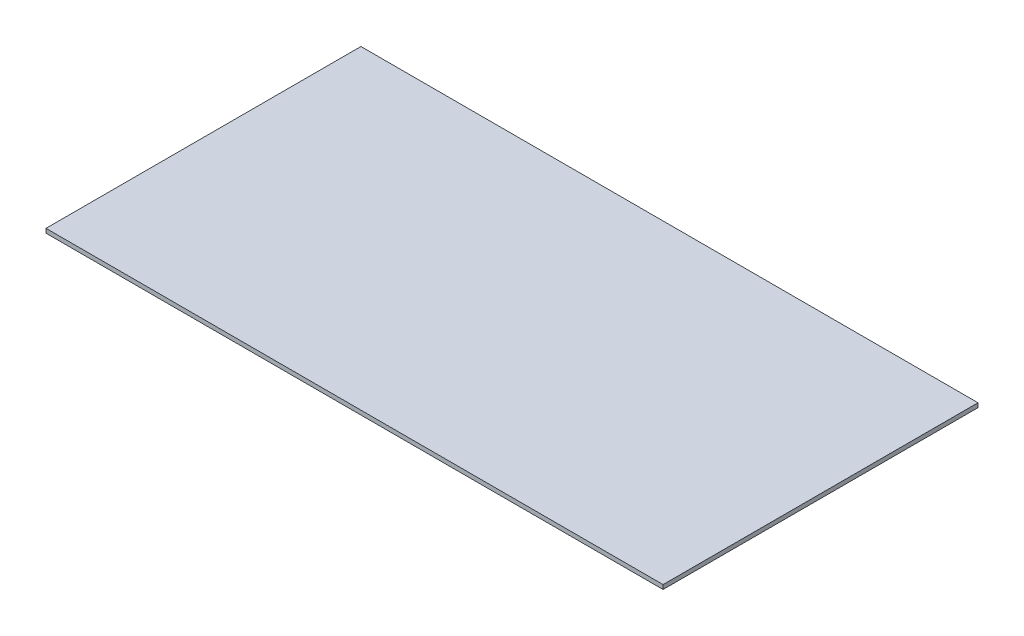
from build123d import *

# Parameters (mm, degrees)
ESQUISSE1_W      = 435
ESQUISSE1_H      = 3
EXTRUSION1_DEPTH = 222


with BuildPart() as part:
    # Esquisse1 → Extrusion1 (new body)
    with BuildSketch(Plane.XY):
        with Locations((217.5, 1.5)):
            Rectangle(ESQUISSE1_W, ESQUISSE1_H)
    extrude(amount=EXTRUSION1_DEPTH)


solid = part.part
